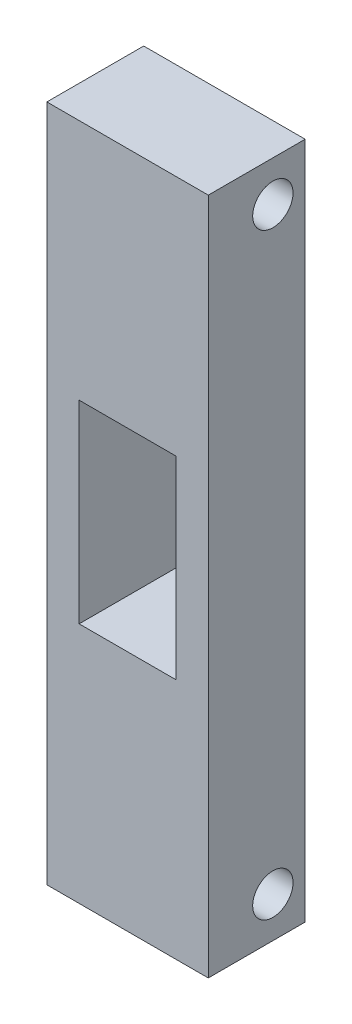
ISO-10303-21;
HEADER;
FILE_DESCRIPTION(('STEP AP214'),'2;1');
FILE_NAME('part.step','',(''),(''),'','','');
FILE_SCHEMA(('AUTOMOTIVE_DESIGN { 1 0 10303 214 1 1 1 1 }'));
ENDSEC;
DATA;
#1=APPLICATION_CONTEXT('core data for automotive mechanical design processes');
#2=APPLICATION_PROTOCOL_DEFINITION('international standard','automotive_design',2000,#1);
#3=PRODUCT_CONTEXT('',#1,'mechanical');
#4=PRODUCT('Part','Part','',(#3));
#5=PRODUCT_RELATED_PRODUCT_CATEGORY('part','',(#4));
#6=PRODUCT_DEFINITION_FORMATION('','',#4);
#7=PRODUCT_DEFINITION_CONTEXT('part definition',#1,'design');
#8=PRODUCT_DEFINITION('design','',#6,#7);
#9=PRODUCT_DEFINITION_SHAPE('','',#8);
#10=(LENGTH_UNIT() NAMED_UNIT(*) SI_UNIT(.MILLI.,.METRE.));
#11=(NAMED_UNIT(*) PLANE_ANGLE_UNIT() SI_UNIT($,.RADIAN.));
#12=(NAMED_UNIT(*) SI_UNIT($,.STERADIAN.) SOLID_ANGLE_UNIT());
#13=UNCERTAINTY_MEASURE_WITH_UNIT(LENGTH_MEASURE(1.E-05),#10,'distance_accuracy_value','');
#14=(GEOMETRIC_REPRESENTATION_CONTEXT(3) GLOBAL_UNCERTAINTY_ASSIGNED_CONTEXT((#13)) GLOBAL_UNIT_ASSIGNED_CONTEXT((#10,
#11,#12)) REPRESENTATION_CONTEXT('',''));
#15=CARTESIAN_POINT('',(0.,0.,0.));
#16=DIRECTION('',(0.,0.,1.));
#17=DIRECTION('',(1.,0.,0.));
#18=AXIS2_PLACEMENT_3D('',#15,#16,#17);
#19=CARTESIAN_POINT('',(0.,0.,6.));
#20=DIRECTION('',(0.,0.,1.));
#21=DIRECTION('',(1.,0.,0.));
#22=AXIS2_PLACEMENT_3D('',#19,#20,#21);
#23=PLANE('',#22);
#24=DIRECTION('',(0.,1.,0.));
#25=VECTOR('',#24,1.);
#26=CARTESIAN_POINT('',(5.,21.,6.));
#27=LINE('',#26,#25);
#28=CARTESIAN_POINT('',(5.,-21.,6.));
#29=VERTEX_POINT('',#28);
#30=CARTESIAN_POINT('',(5.,21.,6.));
#31=VERTEX_POINT('',#30);
#32=EDGE_CURVE('E145',#29,#31,#27,.T.);
#33=ORIENTED_EDGE('',*,*,#32,.T.);
#34=DIRECTION('',(-1.,0.,0.));
#35=VECTOR('',#34,1.);
#36=CARTESIAN_POINT('',(-5.,21.,6.));
#37=LINE('',#36,#35);
#38=CARTESIAN_POINT('',(-5.,21.,6.));
#39=VERTEX_POINT('',#38);
#40=EDGE_CURVE('E148',#31,#39,#37,.T.);
#41=ORIENTED_EDGE('',*,*,#40,.T.);
#42=DIRECTION('',(0.,-1.,0.));
#43=VECTOR('',#42,1.);
#44=CARTESIAN_POINT('',(-5.,21.,6.));
#45=LINE('',#44,#43);
#46=CARTESIAN_POINT('',(-5.,-21.,6.));
#47=VERTEX_POINT('',#46);
#48=EDGE_CURVE('E151',#39,#47,#45,.T.);
#49=ORIENTED_EDGE('',*,*,#48,.T.);
#50=DIRECTION('',(1.,0.,0.));
#51=VECTOR('',#50,1.);
#52=CARTESIAN_POINT('',(-5.,-21.,6.));
#53=LINE('',#52,#51);
#54=EDGE_CURVE('E153',#47,#29,#53,.T.);
#55=ORIENTED_EDGE('',*,*,#54,.T.);
#56=EDGE_LOOP('',(#33,#41,#49,#55));
#57=FACE_BOUND('',#56,.T.);
#58=DIRECTION('',(-1.,0.,0.));
#59=VECTOR('',#58,1.);
#60=CARTESIAN_POINT('',(-3.,6.,6.));
#61=LINE('',#60,#59);
#62=CARTESIAN_POINT('',(3.,6.,6.));
#63=VERTEX_POINT('',#62);
#64=CARTESIAN_POINT('',(-3.,6.,6.));
#65=VERTEX_POINT('',#64);
#66=EDGE_CURVE('E116',#63,#65,#61,.T.);
#67=ORIENTED_EDGE('',*,*,#66,.F.);
#68=DIRECTION('',(0.,1.,0.));
#69=VECTOR('',#68,1.);
#70=CARTESIAN_POINT('',(3.,6.,6.));
#71=LINE('',#70,#69);
#72=CARTESIAN_POINT('',(3.,-6.,6.));
#73=VERTEX_POINT('',#72);
#74=EDGE_CURVE('E108',#73,#63,#71,.T.);
#75=ORIENTED_EDGE('',*,*,#74,.F.);
#76=DIRECTION('',(1.,0.,0.));
#77=VECTOR('',#76,1.);
#78=CARTESIAN_POINT('',(-3.,-6.,6.));
#79=LINE('',#78,#77);
#80=CARTESIAN_POINT('',(-3.,-6.,6.));
#81=VERTEX_POINT('',#80);
#82=EDGE_CURVE('E130',#81,#73,#79,.T.);
#83=ORIENTED_EDGE('',*,*,#82,.F.);
#84=DIRECTION('',(0.,-1.,0.));
#85=VECTOR('',#84,1.);
#86=CARTESIAN_POINT('',(-3.,6.,6.));
#87=LINE('',#86,#85);
#88=EDGE_CURVE('E128',#65,#81,#87,.T.);
#89=ORIENTED_EDGE('',*,*,#88,.F.);
#90=EDGE_LOOP('',(#67,#75,#83,#89));
#91=FACE_BOUND('',#90,.T.);
#92=ADVANCED_FACE('F41',(#57,#91),#23,.T.);
#93=CARTESIAN_POINT('',(0.,0.,0.));
#94=DIRECTION('',(0.,0.,1.));
#95=DIRECTION('',(1.,0.,0.));
#96=AXIS2_PLACEMENT_3D('',#93,#94,#95);
#97=PLANE('',#96);
#98=DIRECTION('',(0.,1.,0.));
#99=VECTOR('',#98,1.);
#100=CARTESIAN_POINT('',(5.,21.,0.));
#101=LINE('',#100,#99);
#102=CARTESIAN_POINT('',(5.,-21.,0.));
#103=VERTEX_POINT('',#102);
#104=CARTESIAN_POINT('',(5.,21.,0.));
#105=VERTEX_POINT('',#104);
#106=EDGE_CURVE('E124',#103,#105,#101,.T.);
#107=ORIENTED_EDGE('',*,*,#106,.F.);
#108=DIRECTION('',(1.,0.,0.));
#109=VECTOR('',#108,1.);
#110=CARTESIAN_POINT('',(-5.,-21.,0.));
#111=LINE('',#110,#109);
#112=CARTESIAN_POINT('',(-5.,-21.,0.));
#113=VERTEX_POINT('',#112);
#114=EDGE_CURVE('E149',#113,#103,#111,.T.);
#115=ORIENTED_EDGE('',*,*,#114,.F.);
#116=DIRECTION('',(0.,-1.,0.));
#117=VECTOR('',#116,1.);
#118=CARTESIAN_POINT('',(-5.,21.,0.));
#119=LINE('',#118,#117);
#120=CARTESIAN_POINT('',(-5.,21.,0.));
#121=VERTEX_POINT('',#120);
#122=EDGE_CURVE('E160',#121,#113,#119,.T.);
#123=ORIENTED_EDGE('',*,*,#122,.F.);
#124=DIRECTION('',(-1.,0.,0.));
#125=VECTOR('',#124,1.);
#126=CARTESIAN_POINT('',(-5.,21.,0.));
#127=LINE('',#126,#125);
#128=EDGE_CURVE('E158',#105,#121,#127,.T.);
#129=ORIENTED_EDGE('',*,*,#128,.F.);
#130=EDGE_LOOP('',(#107,#115,#123,#129));
#131=FACE_BOUND('',#130,.T.);
#132=DIRECTION('',(0.,1.,0.));
#133=VECTOR('',#132,1.);
#134=CARTESIAN_POINT('',(3.,6.,0.));
#135=LINE('',#134,#133);
#136=CARTESIAN_POINT('',(3.,-6.,0.));
#137=VERTEX_POINT('',#136);
#138=CARTESIAN_POINT('',(3.,6.,0.));
#139=VERTEX_POINT('',#138);
#140=EDGE_CURVE('E66',#137,#139,#135,.T.);
#141=ORIENTED_EDGE('',*,*,#140,.T.);
#142=DIRECTION('',(-1.,0.,0.));
#143=VECTOR('',#142,1.);
#144=CARTESIAN_POINT('',(-3.,6.,0.));
#145=LINE('',#144,#143);
#146=CARTESIAN_POINT('',(-3.,6.,0.));
#147=VERTEX_POINT('',#146);
#148=EDGE_CURVE('E123',#139,#147,#145,.T.);
#149=ORIENTED_EDGE('',*,*,#148,.T.);
#150=DIRECTION('',(0.,-1.,0.));
#151=VECTOR('',#150,1.);
#152=CARTESIAN_POINT('',(-3.,6.,0.));
#153=LINE('',#152,#151);
#154=CARTESIAN_POINT('',(-3.,-6.,0.));
#155=VERTEX_POINT('',#154);
#156=EDGE_CURVE('E137',#147,#155,#153,.T.);
#157=ORIENTED_EDGE('',*,*,#156,.T.);
#158=DIRECTION('',(1.,0.,0.));
#159=VECTOR('',#158,1.);
#160=CARTESIAN_POINT('',(-3.,-6.,0.));
#161=LINE('',#160,#159);
#162=EDGE_CURVE('E117',#155,#137,#161,.T.);
#163=ORIENTED_EDGE('',*,*,#162,.T.);
#164=EDGE_LOOP('',(#141,#149,#157,#163));
#165=FACE_BOUND('',#164,.T.);
#166=ADVANCED_FACE('F189',(#131,#165),#97,.F.);
#167=CARTESIAN_POINT('',(5.,21.,6.));
#168=DIRECTION('',(-1.,0.,0.));
#169=DIRECTION('',(0.,0.,1.));
#170=AXIS2_PLACEMENT_3D('',#167,#168,#169);
#171=PLANE('',#170);
#172=CARTESIAN_POINT('',(5.,18.5,2.));
#173=DIRECTION('',(1.,0.,0.));
#174=DIRECTION('',(0.,1.,0.));
#175=AXIS2_PLACEMENT_3D('',#172,#173,#174);
#176=CIRCLE('',#175,1.25);
#177=CARTESIAN_POINT('',(5.,19.75,2.));
#178=VERTEX_POINT('',#177);
#179=EDGE_CURVE('E171',#178,#178,#176,.T.);
#180=ORIENTED_EDGE('',*,*,#179,.F.);
#181=EDGE_LOOP('',(#180));
#182=FACE_BOUND('',#181,.T.);
#183=CARTESIAN_POINT('',(5.,-18.5,2.));
#184=DIRECTION('',(1.,0.,0.));
#185=DIRECTION('',(0.,1.,0.));
#186=AXIS2_PLACEMENT_3D('',#183,#184,#185);
#187=CIRCLE('',#186,1.25);
#188=CARTESIAN_POINT('',(5.,-17.25,2.));
#189=VERTEX_POINT('',#188);
#190=EDGE_CURVE('E176',#189,#189,#187,.T.);
#191=ORIENTED_EDGE('',*,*,#190,.F.);
#192=EDGE_LOOP('',(#191));
#193=FACE_BOUND('',#192,.T.);
#194=ORIENTED_EDGE('',*,*,#106,.T.);
#195=DIRECTION('',(0.,0.,-1.));
#196=VECTOR('',#195,1.);
#197=CARTESIAN_POINT('',(5.,21.,6.));
#198=LINE('',#197,#196);
#199=EDGE_CURVE('E11',#31,#105,#198,.T.);
#200=ORIENTED_EDGE('',*,*,#199,.F.);
#201=ORIENTED_EDGE('',*,*,#32,.F.);
#202=DIRECTION('',(0.,0.,-1.));
#203=VECTOR('',#202,1.);
#204=CARTESIAN_POINT('',(5.,-21.,6.));
#205=LINE('',#204,#203);
#206=EDGE_CURVE('E155',#29,#103,#205,.T.);
#207=ORIENTED_EDGE('',*,*,#206,.T.);
#208=EDGE_LOOP('',(#194,#200,#201,#207));
#209=FACE_BOUND('',#208,.T.);
#210=ADVANCED_FACE('F43',(#182,#193,#209),#171,.F.);
#211=CARTESIAN_POINT('',(-5.,21.,6.));
#212=DIRECTION('',(0.,-1.,0.));
#213=DIRECTION('',(0.,0.,-1.));
#214=AXIS2_PLACEMENT_3D('',#211,#212,#213);
#215=PLANE('',#214);
#216=ORIENTED_EDGE('',*,*,#128,.T.);
#217=DIRECTION('',(0.,0.,-1.));
#218=VECTOR('',#217,1.);
#219=CARTESIAN_POINT('',(-5.,21.,6.));
#220=LINE('',#219,#218);
#221=EDGE_CURVE('E50',#39,#121,#220,.T.);
#222=ORIENTED_EDGE('',*,*,#221,.F.);
#223=ORIENTED_EDGE('',*,*,#40,.F.);
#224=ORIENTED_EDGE('',*,*,#199,.T.);
#225=EDGE_LOOP('',(#216,#222,#223,#224));
#226=FACE_BOUND('',#225,.T.);
#227=ADVANCED_FACE('F188',(#226),#215,.F.);
#228=CARTESIAN_POINT('',(-5.,21.,6.));
#229=DIRECTION('',(1.,0.,0.));
#230=DIRECTION('',(0.,0.,-1.));
#231=AXIS2_PLACEMENT_3D('',#228,#229,#230);
#232=PLANE('',#231);
#233=CARTESIAN_POINT('',(-5.,18.5,2.));
#234=DIRECTION('',(1.,0.,0.));
#235=DIRECTION('',(0.,0.,-1.));
#236=AXIS2_PLACEMENT_3D('',#233,#234,#235);
#237=CIRCLE('',#236,1.25);
#238=CARTESIAN_POINT('',(-5.,18.5,0.749999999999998));
#239=VERTEX_POINT('',#238);
#240=EDGE_CURVE('E45',#239,#239,#237,.T.);
#241=ORIENTED_EDGE('',*,*,#240,.T.);
#242=EDGE_LOOP('',(#241));
#243=FACE_BOUND('',#242,.T.);
#244=CARTESIAN_POINT('',(-5.,-18.5,2.));
#245=DIRECTION('',(1.,0.,0.));
#246=DIRECTION('',(0.,0.,-1.));
#247=AXIS2_PLACEMENT_3D('',#244,#245,#246);
#248=CIRCLE('',#247,1.25);
#249=CARTESIAN_POINT('',(-5.,-18.5,0.749999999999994));
#250=VERTEX_POINT('',#249);
#251=EDGE_CURVE('E169',#250,#250,#248,.T.);
#252=ORIENTED_EDGE('',*,*,#251,.T.);
#253=EDGE_LOOP('',(#252));
#254=FACE_BOUND('',#253,.T.);
#255=ORIENTED_EDGE('',*,*,#122,.T.);
#256=DIRECTION('',(0.,0.,-1.));
#257=VECTOR('',#256,1.);
#258=CARTESIAN_POINT('',(-5.,-21.,6.));
#259=LINE('',#258,#257);
#260=EDGE_CURVE('E165',#47,#113,#259,.T.);
#261=ORIENTED_EDGE('',*,*,#260,.F.);
#262=ORIENTED_EDGE('',*,*,#48,.F.);
#263=ORIENTED_EDGE('',*,*,#221,.T.);
#264=EDGE_LOOP('',(#255,#261,#262,#263));
#265=FACE_BOUND('',#264,.T.);
#266=ADVANCED_FACE('F208',(#243,#254,#265),#232,.F.);
#267=CARTESIAN_POINT('',(-5.,-21.,6.));
#268=DIRECTION('',(0.,1.,0.));
#269=DIRECTION('',(0.,0.,1.));
#270=AXIS2_PLACEMENT_3D('',#267,#268,#269);
#271=PLANE('',#270);
#272=ORIENTED_EDGE('',*,*,#114,.T.);
#273=ORIENTED_EDGE('',*,*,#206,.F.);
#274=ORIENTED_EDGE('',*,*,#54,.F.);
#275=ORIENTED_EDGE('',*,*,#260,.T.);
#276=EDGE_LOOP('',(#272,#273,#274,#275));
#277=FACE_BOUND('',#276,.T.);
#278=ADVANCED_FACE('F206',(#277),#271,.F.);
#279=CARTESIAN_POINT('',(3.,6.,6.));
#280=DIRECTION('',(-1.,0.,0.));
#281=DIRECTION('',(0.,0.,1.));
#282=AXIS2_PLACEMENT_3D('',#279,#280,#281);
#283=PLANE('',#282);
#284=ORIENTED_EDGE('',*,*,#140,.F.);
#285=DIRECTION('',(0.,0.,-1.));
#286=VECTOR('',#285,1.);
#287=CARTESIAN_POINT('',(3.,-6.,6.));
#288=LINE('',#287,#286);
#289=EDGE_CURVE('E112',#73,#137,#288,.T.);
#290=ORIENTED_EDGE('',*,*,#289,.F.);
#291=ORIENTED_EDGE('',*,*,#74,.T.);
#292=DIRECTION('',(0.,0.,-1.));
#293=VECTOR('',#292,1.);
#294=CARTESIAN_POINT('',(3.,6.,6.));
#295=LINE('',#294,#293);
#296=EDGE_CURVE('E111',#63,#139,#295,.T.);
#297=ORIENTED_EDGE('',*,*,#296,.T.);
#298=EDGE_LOOP('',(#284,#290,#291,#297));
#299=FACE_BOUND('',#298,.T.);
#300=ADVANCED_FACE('F110',(#299),#283,.T.);
#301=CARTESIAN_POINT('',(-3.,6.,6.));
#302=DIRECTION('',(0.,-1.,0.));
#303=DIRECTION('',(0.,0.,-1.));
#304=AXIS2_PLACEMENT_3D('',#301,#302,#303);
#305=PLANE('',#304);
#306=ORIENTED_EDGE('',*,*,#148,.F.);
#307=ORIENTED_EDGE('',*,*,#296,.F.);
#308=ORIENTED_EDGE('',*,*,#66,.T.);
#309=DIRECTION('',(0.,0.,-1.));
#310=VECTOR('',#309,1.);
#311=CARTESIAN_POINT('',(-3.,6.,6.));
#312=LINE('',#311,#310);
#313=EDGE_CURVE('E125',#65,#147,#312,.T.);
#314=ORIENTED_EDGE('',*,*,#313,.T.);
#315=EDGE_LOOP('',(#306,#307,#308,#314));
#316=FACE_BOUND('',#315,.T.);
#317=ADVANCED_FACE('F120',(#316),#305,.T.);
#318=CARTESIAN_POINT('',(-3.,6.,6.));
#319=DIRECTION('',(1.,0.,0.));
#320=DIRECTION('',(0.,0.,-1.));
#321=AXIS2_PLACEMENT_3D('',#318,#319,#320);
#322=PLANE('',#321);
#323=ORIENTED_EDGE('',*,*,#156,.F.);
#324=ORIENTED_EDGE('',*,*,#313,.F.);
#325=ORIENTED_EDGE('',*,*,#88,.T.);
#326=DIRECTION('',(0.,0.,-1.));
#327=VECTOR('',#326,1.);
#328=CARTESIAN_POINT('',(-3.,-6.,6.));
#329=LINE('',#328,#327);
#330=EDGE_CURVE('E58',#81,#155,#329,.T.);
#331=ORIENTED_EDGE('',*,*,#330,.T.);
#332=EDGE_LOOP('',(#323,#324,#325,#331));
#333=FACE_BOUND('',#332,.T.);
#334=ADVANCED_FACE('F229',(#333),#322,.T.);
#335=CARTESIAN_POINT('',(-3.,-6.,6.));
#336=DIRECTION('',(0.,1.,0.));
#337=DIRECTION('',(0.,0.,1.));
#338=AXIS2_PLACEMENT_3D('',#335,#336,#337);
#339=PLANE('',#338);
#340=ORIENTED_EDGE('',*,*,#162,.F.);
#341=ORIENTED_EDGE('',*,*,#330,.F.);
#342=ORIENTED_EDGE('',*,*,#82,.T.);
#343=ORIENTED_EDGE('',*,*,#289,.T.);
#344=EDGE_LOOP('',(#340,#341,#342,#343));
#345=FACE_BOUND('',#344,.T.);
#346=ADVANCED_FACE('F232',(#345),#339,.T.);
#347=CARTESIAN_POINT('',(-7.,-18.5,2.));
#348=DIRECTION('',(1.,0.,0.));
#349=DIRECTION('',(0.,1.,0.));
#350=AXIS2_PLACEMENT_3D('',#347,#348,#349);
#351=CYLINDRICAL_SURFACE('',#350,1.25);
#352=ORIENTED_EDGE('',*,*,#190,.T.);
#353=EDGE_LOOP('',(#352));
#354=FACE_BOUND('',#353,.T.);
#355=ORIENTED_EDGE('',*,*,#251,.F.);
#356=EDGE_LOOP('',(#355));
#357=FACE_BOUND('',#356,.T.);
#358=ADVANCED_FACE('F183',(#354,#357),#351,.F.);
#359=CARTESIAN_POINT('',(-7.,18.5,2.));
#360=DIRECTION('',(1.,0.,0.));
#361=DIRECTION('',(0.,1.,0.));
#362=AXIS2_PLACEMENT_3D('',#359,#360,#361);
#363=CYLINDRICAL_SURFACE('',#362,1.25);
#364=ORIENTED_EDGE('',*,*,#179,.T.);
#365=EDGE_LOOP('',(#364));
#366=FACE_BOUND('',#365,.T.);
#367=ORIENTED_EDGE('',*,*,#240,.F.);
#368=EDGE_LOOP('',(#367));
#369=FACE_BOUND('',#368,.T.);
#370=ADVANCED_FACE('F237',(#366,#369),#363,.F.);
#371=CLOSED_SHELL('',(#92,#166,#210,#227,#266,#278,#300,#317,#334,#346,#358,#370));
#372=MANIFOLD_SOLID_BREP('B2',#371);
#373=ADVANCED_BREP_SHAPE_REPRESENTATION('',(#18,#372),#14);
#374=SHAPE_DEFINITION_REPRESENTATION(#9,#373);
ENDSEC;
END-ISO-10303-21;
